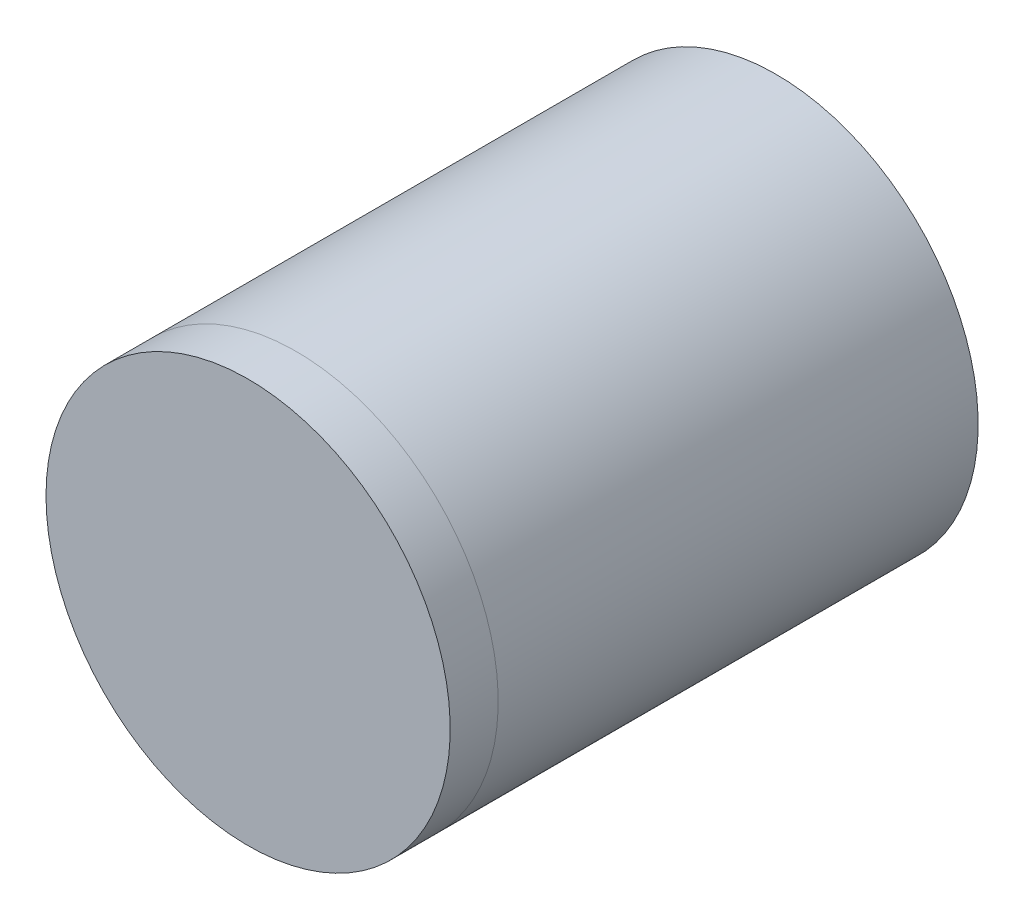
from build123d import *

# Parameters (mm, degrees)
ESQUISSECORPS_W = 8.0005
ESQUISSECORPS_H = 1.9
ESQUISSE1_W     = 8
ESQUISSE1_H     = 19


with BuildPart() as part:
    # EsquisseCorps → Base-R_volution (revolve)
    with BuildSketch(Plane(origin=(0, 0, 0), x_dir=(1, 0, 0), z_dir=(0, 1, 0)), mode=Mode.PRIVATE) as base_r_volution_sk:
        with Locations((4.00025, -19.949)):
            Rectangle(ESQUISSECORPS_W, ESQUISSECORPS_H)
    revolve(base_r_volution_sk.sketch.rotate(Axis((0, 0, 0), (0, 0, 1)), 180), axis=Axis((0, 0, 0), (0, 0, 1)))

    # Esquisse1 → Boss.-R_vol.1 (revolve)
    with BuildSketch(Plane(origin=(0, 0, 0), x_dir=(1, 0, 0), z_dir=(0, 1, 0)), mode=Mode.PRIVATE) as boss_r_vol_1_sk:
        with Locations((4, -9.499)):
            Rectangle(ESQUISSE1_W, ESQUISSE1_H)
    revolve(boss_r_vol_1_sk.sketch.rotate(Axis((0, 0, -0.001), (0, 0, 1)), 180), axis=Axis((0, 0, -0.001), (0, 0, 1)))


solid = part.part
